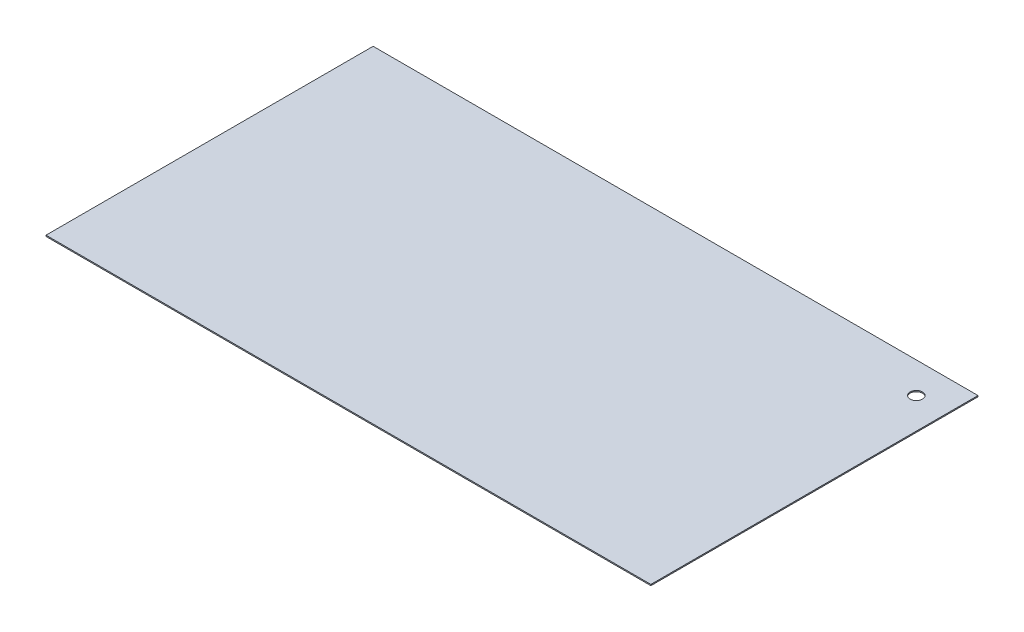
ISO-10303-21;
HEADER;
FILE_DESCRIPTION(('STEP AP214'),'2;1');
FILE_NAME('part.step','',(''),(''),'','','');
FILE_SCHEMA(('AUTOMOTIVE_DESIGN { 1 0 10303 214 1 1 1 1 }'));
ENDSEC;
DATA;
#1=APPLICATION_CONTEXT('core data for automotive mechanical design processes');
#2=APPLICATION_PROTOCOL_DEFINITION('international standard','automotive_design',2000,#1);
#3=PRODUCT_CONTEXT('',#1,'mechanical');
#4=PRODUCT('Part','Part','',(#3));
#5=PRODUCT_RELATED_PRODUCT_CATEGORY('part','',(#4));
#6=PRODUCT_DEFINITION_FORMATION('','',#4);
#7=PRODUCT_DEFINITION_CONTEXT('part definition',#1,'design');
#8=PRODUCT_DEFINITION('design','',#6,#7);
#9=PRODUCT_DEFINITION_SHAPE('','',#8);
#10=(LENGTH_UNIT() NAMED_UNIT(*) SI_UNIT(.MILLI.,.METRE.));
#11=(NAMED_UNIT(*) PLANE_ANGLE_UNIT() SI_UNIT($,.RADIAN.));
#12=(NAMED_UNIT(*) SI_UNIT($,.STERADIAN.) SOLID_ANGLE_UNIT());
#13=UNCERTAINTY_MEASURE_WITH_UNIT(LENGTH_MEASURE(1.E-05),#10,'distance_accuracy_value','');
#14=(GEOMETRIC_REPRESENTATION_CONTEXT(3) GLOBAL_UNCERTAINTY_ASSIGNED_CONTEXT((#13)) GLOBAL_UNIT_ASSIGNED_CONTEXT((#10,
#11,#12)) REPRESENTATION_CONTEXT('',''));
#15=CARTESIAN_POINT('',(0.,0.,0.));
#16=DIRECTION('',(0.,0.,1.));
#17=DIRECTION('',(1.,0.,0.));
#18=AXIS2_PLACEMENT_3D('',#15,#16,#17);
#19=CARTESIAN_POINT('',(0.,9.525,0.));
#20=DIRECTION('',(1.,0.,0.));
#21=DIRECTION('',(0.,0.,-1.));
#22=AXIS2_PLACEMENT_3D('',#19,#20,#21);
#23=PLANE('',#22);
#24=DIRECTION('',(0.,0.,1.));
#25=VECTOR('',#24,1.);
#26=CARTESIAN_POINT('',(0.,0.,0.));
#27=LINE('',#26,#25);
#28=CARTESIAN_POINT('',(0.,0.,-2692.4));
#29=VERTEX_POINT('',#28);
#30=CARTESIAN_POINT('',(0.,0.,0.));
#31=VERTEX_POINT('',#30);
#32=EDGE_CURVE('E95',#29,#31,#27,.T.);
#33=ORIENTED_EDGE('',*,*,#32,.T.);
#34=DIRECTION('',(0.,-1.,0.));
#35=VECTOR('',#34,1.);
#36=CARTESIAN_POINT('',(0.,9.525,0.));
#37=LINE('',#36,#35);
#38=CARTESIAN_POINT('',(0.,9.525,0.));
#39=VERTEX_POINT('',#38);
#40=EDGE_CURVE('E11',#39,#31,#37,.T.);
#41=ORIENTED_EDGE('',*,*,#40,.F.);
#42=DIRECTION('',(0.,0.,1.));
#43=VECTOR('',#42,1.);
#44=CARTESIAN_POINT('',(0.,9.525,0.));
#45=LINE('',#44,#43);
#46=CARTESIAN_POINT('',(0.,9.525,-2692.4));
#47=VERTEX_POINT('',#46);
#48=EDGE_CURVE('E83',#47,#39,#45,.T.);
#49=ORIENTED_EDGE('',*,*,#48,.F.);
#50=DIRECTION('',(0.,-1.,0.));
#51=VECTOR('',#50,1.);
#52=CARTESIAN_POINT('',(0.,9.525,-2692.4));
#53=LINE('',#52,#51);
#54=EDGE_CURVE('E91',#47,#29,#53,.T.);
#55=ORIENTED_EDGE('',*,*,#54,.T.);
#56=EDGE_LOOP('',(#33,#41,#49,#55));
#57=FACE_BOUND('',#56,.T.);
#58=ADVANCED_FACE('F32',(#57),#23,.F.);
#59=CARTESIAN_POINT('',(0.,9.525,0.));
#60=DIRECTION('',(0.,0.,-1.));
#61=DIRECTION('',(-1.,0.,0.));
#62=AXIS2_PLACEMENT_3D('',#59,#60,#61);
#63=PLANE('',#62);
#64=DIRECTION('',(1.,0.,0.));
#65=VECTOR('',#64,1.);
#66=CARTESIAN_POINT('',(0.,0.,0.));
#67=LINE('',#66,#65);
#68=CARTESIAN_POINT('',(4978.4,0.,0.));
#69=VERTEX_POINT('',#68);
#70=EDGE_CURVE('E87',#31,#69,#67,.T.);
#71=ORIENTED_EDGE('',*,*,#70,.T.);
#72=DIRECTION('',(0.,-1.,0.));
#73=VECTOR('',#72,1.);
#74=CARTESIAN_POINT('',(4978.4,9.525,0.));
#75=LINE('',#74,#73);
#76=CARTESIAN_POINT('',(4978.4,9.525,0.));
#77=VERTEX_POINT('',#76);
#78=EDGE_CURVE('E40',#77,#69,#75,.T.);
#79=ORIENTED_EDGE('',*,*,#78,.F.);
#80=DIRECTION('',(1.,0.,0.));
#81=VECTOR('',#80,1.);
#82=CARTESIAN_POINT('',(0.,9.525,0.));
#83=LINE('',#82,#81);
#84=EDGE_CURVE('E78',#39,#77,#83,.T.);
#85=ORIENTED_EDGE('',*,*,#84,.F.);
#86=ORIENTED_EDGE('',*,*,#40,.T.);
#87=EDGE_LOOP('',(#71,#79,#85,#86));
#88=FACE_BOUND('',#87,.T.);
#89=ADVANCED_FACE('F86',(#88),#63,.F.);
#90=CARTESIAN_POINT('',(4978.4,9.525,0.));
#91=DIRECTION('',(-1.,0.,0.));
#92=DIRECTION('',(0.,0.,1.));
#93=AXIS2_PLACEMENT_3D('',#90,#91,#92);
#94=PLANE('',#93);
#95=DIRECTION('',(0.,0.,-1.));
#96=VECTOR('',#95,1.);
#97=CARTESIAN_POINT('',(4978.4,0.,0.));
#98=LINE('',#97,#96);
#99=CARTESIAN_POINT('',(4978.4,0.,-2692.4));
#100=VERTEX_POINT('',#99);
#101=EDGE_CURVE('E65',#69,#100,#98,.T.);
#102=ORIENTED_EDGE('',*,*,#101,.T.);
#103=DIRECTION('',(0.,-1.,0.));
#104=VECTOR('',#103,1.);
#105=CARTESIAN_POINT('',(4978.4,9.525,-2692.4));
#106=LINE('',#105,#104);
#107=CARTESIAN_POINT('',(4978.4,9.525,-2692.4));
#108=VERTEX_POINT('',#107);
#109=EDGE_CURVE('E88',#108,#100,#106,.T.);
#110=ORIENTED_EDGE('',*,*,#109,.F.);
#111=DIRECTION('',(0.,0.,-1.));
#112=VECTOR('',#111,1.);
#113=CARTESIAN_POINT('',(4978.4,9.525,0.));
#114=LINE('',#113,#112);
#115=EDGE_CURVE('E81',#77,#108,#114,.T.);
#116=ORIENTED_EDGE('',*,*,#115,.F.);
#117=ORIENTED_EDGE('',*,*,#78,.T.);
#118=EDGE_LOOP('',(#102,#110,#116,#117));
#119=FACE_BOUND('',#118,.T.);
#120=ADVANCED_FACE('F89',(#119),#94,.F.);
#121=CARTESIAN_POINT('',(0.,9.525,-2692.4));
#122=DIRECTION('',(0.,0.,1.));
#123=DIRECTION('',(1.,0.,0.));
#124=AXIS2_PLACEMENT_3D('',#121,#122,#123);
#125=PLANE('',#124);
#126=DIRECTION('',(-1.,0.,0.));
#127=VECTOR('',#126,1.);
#128=CARTESIAN_POINT('',(0.,0.,-2692.4));
#129=LINE('',#128,#127);
#130=EDGE_CURVE('E71',#100,#29,#129,.T.);
#131=ORIENTED_EDGE('',*,*,#130,.T.);
#132=ORIENTED_EDGE('',*,*,#54,.F.);
#133=DIRECTION('',(-1.,0.,0.));
#134=VECTOR('',#133,1.);
#135=CARTESIAN_POINT('',(0.,9.525,-2692.4));
#136=LINE('',#135,#134);
#137=EDGE_CURVE('E48',#108,#47,#136,.T.);
#138=ORIENTED_EDGE('',*,*,#137,.F.);
#139=ORIENTED_EDGE('',*,*,#109,.T.);
#140=EDGE_LOOP('',(#131,#132,#138,#139));
#141=FACE_BOUND('',#140,.T.);
#142=ADVANCED_FACE('F103',(#141),#125,.F.);
#143=CARTESIAN_POINT('',(0.,9.525,-2692.4));
#144=DIRECTION('',(0.,-1.,0.));
#145=DIRECTION('',(0.,0.,-1.));
#146=AXIS2_PLACEMENT_3D('',#143,#144,#145);
#147=PLANE('',#146);
#148=CARTESIAN_POINT('',(4724.4,9.525,-2438.4));
#149=DIRECTION('',(0.,1.,0.));
#150=DIRECTION('',(0.,0.,1.));
#151=AXIS2_PLACEMENT_3D('',#148,#149,#150);
#152=CIRCLE('',#151,51.1962400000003);
#153=CARTESIAN_POINT('',(4724.4,9.525,-2387.20376));
#154=VERTEX_POINT('',#153);
#155=EDGE_CURVE('E111',#154,#154,#152,.T.);
#156=ORIENTED_EDGE('',*,*,#155,.F.);
#157=EDGE_LOOP('',(#156));
#158=FACE_BOUND('',#157,.T.);
#159=ORIENTED_EDGE('',*,*,#48,.T.);
#160=ORIENTED_EDGE('',*,*,#84,.T.);
#161=ORIENTED_EDGE('',*,*,#115,.T.);
#162=ORIENTED_EDGE('',*,*,#137,.T.);
#163=EDGE_LOOP('',(#159,#160,#161,#162));
#164=FACE_BOUND('',#163,.T.);
#165=ADVANCED_FACE('F79',(#158,#164),#147,.F.);
#166=CARTESIAN_POINT('',(0.,0.,-2692.4));
#167=DIRECTION('',(0.,-1.,0.));
#168=DIRECTION('',(0.,0.,-1.));
#169=AXIS2_PLACEMENT_3D('',#166,#167,#168);
#170=PLANE('',#169);
#171=CARTESIAN_POINT('',(4724.4,0.,-2438.4));
#172=DIRECTION('',(0.,1.,0.));
#173=DIRECTION('',(0.,0.,1.));
#174=AXIS2_PLACEMENT_3D('',#171,#172,#173);
#175=CIRCLE('',#174,51.1962400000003);
#176=CARTESIAN_POINT('',(4724.4,0.,-2387.20376));
#177=VERTEX_POINT('',#176);
#178=EDGE_CURVE('E98',#177,#177,#175,.T.);
#179=ORIENTED_EDGE('',*,*,#178,.T.);
#180=EDGE_LOOP('',(#179));
#181=FACE_BOUND('',#180,.T.);
#182=ORIENTED_EDGE('',*,*,#32,.F.);
#183=ORIENTED_EDGE('',*,*,#130,.F.);
#184=ORIENTED_EDGE('',*,*,#101,.F.);
#185=ORIENTED_EDGE('',*,*,#70,.F.);
#186=EDGE_LOOP('',(#182,#183,#184,#185));
#187=FACE_BOUND('',#186,.T.);
#188=ADVANCED_FACE('F106',(#181,#187),#170,.T.);
#189=CARTESIAN_POINT('',(4724.4,9.525,-2438.4));
#190=DIRECTION('',(0.,1.,0.));
#191=DIRECTION('',(0.,0.,1.));
#192=AXIS2_PLACEMENT_3D('',#189,#190,#191);
#193=CYLINDRICAL_SURFACE('',#192,51.1962400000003);
#194=ORIENTED_EDGE('',*,*,#178,.F.);
#195=EDGE_LOOP('',(#194));
#196=FACE_BOUND('',#195,.T.);
#197=ORIENTED_EDGE('',*,*,#155,.T.);
#198=EDGE_LOOP('',(#197));
#199=FACE_BOUND('',#198,.T.);
#200=ADVANCED_FACE('F115',(#196,#199),#193,.F.);
#201=CLOSED_SHELL('',(#58,#89,#120,#142,#165,#188,#200));
#202=MANIFOLD_SOLID_BREP('B2',#201);
#203=ADVANCED_BREP_SHAPE_REPRESENTATION('',(#18,#202),#14);
#204=SHAPE_DEFINITION_REPRESENTATION(#9,#203);
ENDSEC;
END-ISO-10303-21;
